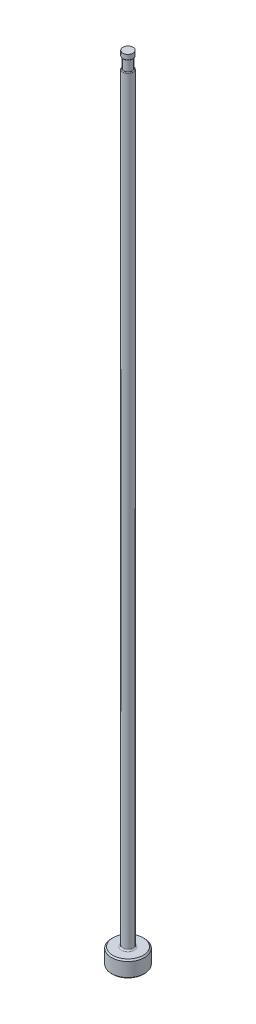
ISO-10303-21;
HEADER;
FILE_DESCRIPTION(('STEP AP214'),'2;1');
FILE_NAME('part.step','',(''),(''),'','','');
FILE_SCHEMA(('AUTOMOTIVE_DESIGN { 1 0 10303 214 1 1 1 1 }'));
ENDSEC;
DATA;
#1=APPLICATION_CONTEXT('core data for automotive mechanical design processes');
#2=APPLICATION_PROTOCOL_DEFINITION('international standard','automotive_design',2000,#1);
#3=PRODUCT_CONTEXT('',#1,'mechanical');
#4=PRODUCT('Part','Part','',(#3));
#5=PRODUCT_RELATED_PRODUCT_CATEGORY('part','',(#4));
#6=PRODUCT_DEFINITION_FORMATION('','',#4);
#7=PRODUCT_DEFINITION_CONTEXT('part definition',#1,'design');
#8=PRODUCT_DEFINITION('design','',#6,#7);
#9=PRODUCT_DEFINITION_SHAPE('','',#8);
#10=(LENGTH_UNIT() NAMED_UNIT(*) SI_UNIT(.MILLI.,.METRE.));
#11=(NAMED_UNIT(*) PLANE_ANGLE_UNIT() SI_UNIT($,.RADIAN.));
#12=(NAMED_UNIT(*) SI_UNIT($,.STERADIAN.) SOLID_ANGLE_UNIT());
#13=UNCERTAINTY_MEASURE_WITH_UNIT(LENGTH_MEASURE(1.E-05),#10,'distance_accuracy_value','');
#14=(GEOMETRIC_REPRESENTATION_CONTEXT(3) GLOBAL_UNCERTAINTY_ASSIGNED_CONTEXT((#13)) GLOBAL_UNIT_ASSIGNED_CONTEXT((#10,
#11,#12)) REPRESENTATION_CONTEXT('',''));
#15=CARTESIAN_POINT('',(0.,0.,0.));
#16=DIRECTION('',(0.,0.,1.));
#17=DIRECTION('',(1.,0.,0.));
#18=AXIS2_PLACEMENT_3D('',#15,#16,#17);
#19=CARTESIAN_POINT('',(-0.991869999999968,151.384,0.));
#20=DIRECTION('',(0.,1.,0.));
#21=DIRECTION('',(0.,0.,1.));
#22=AXIS2_PLACEMENT_3D('',#19,#20,#21);
#23=PLANE('',#22);
#24=CARTESIAN_POINT('',(0.,151.384,0.));
#25=DIRECTION('',(0.,1.,0.));
#26=DIRECTION('',(0.,0.,1.));
#27=AXIS2_PLACEMENT_3D('',#24,#25,#26);
#28=CIRCLE('',#27,0.859789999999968);
#29=CARTESIAN_POINT('',(0.,151.384,0.859789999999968));
#30=VERTEX_POINT('',#29);
#31=EDGE_CURVE('E11',#30,#30,#28,.F.);
#32=ORIENTED_EDGE('',*,*,#31,.T.);
#33=EDGE_LOOP('',(#32));
#34=FACE_BOUND('',#33,.T.);
#35=CARTESIAN_POINT('',(0.,151.384,0.));
#36=DIRECTION('',(0.,1.,0.));
#37=DIRECTION('',(0.,0.,1.));
#38=AXIS2_PLACEMENT_3D('',#35,#36,#37);
#39=CIRCLE('',#38,0.788669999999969);
#40=CARTESIAN_POINT('',(0.,151.384,0.788669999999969));
#41=VERTEX_POINT('',#40);
#42=EDGE_CURVE('E78',#41,#41,#39,.T.);
#43=ORIENTED_EDGE('',*,*,#42,.T.);
#44=EDGE_LOOP('',(#43));
#45=FACE_BOUND('',#44,.T.);
#46=ADVANCED_FACE('F36',(#34,#45),#23,.F.);
#47=CARTESIAN_POINT('',(0.,259.958771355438,0.));
#48=DIRECTION('',(0.,1.,0.));
#49=DIRECTION('',(0.,0.,1.));
#50=AXIS2_PLACEMENT_3D('',#47,#48,#49);
#51=CYLINDRICAL_SURFACE('',#50,0.991869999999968);
#52=DIRECTION('',(0.,1.,0.));
#53=VECTOR('',#52,1.);
#54=CARTESIAN_POINT('',(-0.788669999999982,259.958771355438,-0.601502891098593));
#55=LINE('',#54,#53);
#56=CARTESIAN_POINT('',(-0.788669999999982,149.225,-0.601502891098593));
#57=VERTEX_POINT('',#56);
#58=CARTESIAN_POINT('',(-0.788669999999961,86.868,-0.601502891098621));
#59=VERTEX_POINT('',#58);
#60=EDGE_CURVE('E73',#57,#59,#55,.F.);
#61=ORIENTED_EDGE('',*,*,#60,.F.);
#62=CARTESIAN_POINT('',(0.,149.225,0.));
#63=DIRECTION('',(0.,-1.,0.));
#64=DIRECTION('',(0.,0.,-1.));
#65=AXIS2_PLACEMENT_3D('',#62,#63,#64);
#66=CIRCLE('',#65,0.991869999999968);
#67=CARTESIAN_POINT('',(-0.788669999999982,149.225,0.601502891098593));
#68=VERTEX_POINT('',#67);
#69=EDGE_CURVE('E51',#57,#68,#66,.T.);
#70=ORIENTED_EDGE('',*,*,#69,.T.);
#71=DIRECTION('',(0.,1.,0.));
#72=VECTOR('',#71,1.);
#73=CARTESIAN_POINT('',(-0.788669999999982,259.958771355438,0.601502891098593));
#74=LINE('',#73,#72);
#75=CARTESIAN_POINT('',(-0.788669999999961,86.868,0.601502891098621));
#76=VERTEX_POINT('',#75);
#77=EDGE_CURVE('E84',#76,#68,#74,.T.);
#78=ORIENTED_EDGE('',*,*,#77,.F.);
#79=CARTESIAN_POINT('',(-0.78866999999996,86.868,-0.601502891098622));
#80=CARTESIAN_POINT('',(-0.788666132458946,86.8263657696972,-0.601487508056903));
#81=CARTESIAN_POINT('',(-0.789488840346,86.7847268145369,-0.600428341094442));
#82=CARTESIAN_POINT('',(-0.792762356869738,86.7015772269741,-0.596110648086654));
#83=CARTESIAN_POINT('',(-0.795215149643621,86.6600668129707,-0.5928494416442));
#84=CARTESIAN_POINT('',(-0.80175031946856,86.5770760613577,-0.583979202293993));
#85=CARTESIAN_POINT('',(-0.805845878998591,86.5355987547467,-0.57835115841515));
#86=CARTESIAN_POINT('',(-0.815598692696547,86.4532848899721,-0.564514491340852));
#87=CARTESIAN_POINT('',(-0.821255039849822,86.4124479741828,-0.556307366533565));
#88=CARTESIAN_POINT('',(-0.835799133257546,86.3204854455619,-0.534292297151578));
#89=CARTESIAN_POINT('',(-0.845147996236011,86.269646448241,-0.51956237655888));
#90=CARTESIAN_POINT('',(-0.865829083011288,86.1704630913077,-0.484320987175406));
#91=CARTESIAN_POINT('',(-0.877157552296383,86.122114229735,-0.463820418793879));
#92=CARTESIAN_POINT('',(-0.898053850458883,86.041005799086,-0.421558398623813));
#93=CARTESIAN_POINT('',(-0.907358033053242,86.0073614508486,-0.401380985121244));
#94=CARTESIAN_POINT('',(-0.926056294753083,85.9435419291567,-0.356125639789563));
#95=CARTESIAN_POINT('',(-0.935450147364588,85.9133597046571,-0.331057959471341));
#96=CARTESIAN_POINT('',(-0.950231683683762,85.8679121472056,-0.285005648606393));
#97=CARTESIAN_POINT('',(-0.955876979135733,85.8511082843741,-0.265630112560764));
#98=CARTESIAN_POINT('',(-0.966384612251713,85.8205435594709,-0.224405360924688));
#99=CARTESIAN_POINT('',(-0.971247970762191,85.8067787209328,-0.202559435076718));
#100=CARTESIAN_POINT('',(-0.978947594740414,85.7853348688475,-0.160730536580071));
#101=CARTESIAN_POINT('',(-0.981991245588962,85.7770060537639,-0.141121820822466));
#102=CARTESIAN_POINT('',(-0.986954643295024,85.7635350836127,-0.100697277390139));
#103=CARTESIAN_POINT('',(-0.988875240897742,85.7583905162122,-0.0798823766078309));
#104=CARTESIAN_POINT('',(-0.991389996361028,85.7516710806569,-0.037480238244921));
#105=CARTESIAN_POINT('',(-0.991977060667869,85.7501153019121,-0.0158894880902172));
#106=CARTESIAN_POINT('',(-0.991730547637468,85.7507708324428,0.0272258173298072));
#107=CARTESIAN_POINT('',(-0.990897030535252,85.7529819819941,0.0487503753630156));
#108=CARTESIAN_POINT('',(-0.988037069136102,85.7606392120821,0.0892607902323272));
#109=CARTESIAN_POINT('',(-0.986115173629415,85.765802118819,0.108309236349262));
#110=CARTESIAN_POINT('',(-0.98134109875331,85.7787860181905,0.145344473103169));
#111=CARTESIAN_POINT('',(-0.978488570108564,85.7866080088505,0.163330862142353));
#112=CARTESIAN_POINT('',(-0.970708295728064,85.8082895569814,0.205331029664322));
#113=CARTESIAN_POINT('',(-0.96541298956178,85.8233036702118,0.228680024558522));
#114=CARTESIAN_POINT('',(-0.953964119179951,85.8567581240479,0.272534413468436));
#115=CARTESIAN_POINT('',(-0.947808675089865,85.8752059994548,0.293033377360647));
#116=CARTESIAN_POINT('',(-0.931801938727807,85.9249271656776,0.341318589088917));
#117=CARTESIAN_POINT('',(-0.921702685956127,85.9578591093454,0.367302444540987));
#118=CARTESIAN_POINT('',(-0.901756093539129,86.0273884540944,0.413864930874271));
#119=CARTESIAN_POINT('',(-0.891909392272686,86.0639941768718,0.43443088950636));
#120=CARTESIAN_POINT('',(-0.874578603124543,86.1336825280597,0.468207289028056));
#121=CARTESIAN_POINT('',(-0.866965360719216,86.1664263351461,0.482064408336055));
#122=CARTESIAN_POINT('',(-0.852602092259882,86.23313810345,0.507032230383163));
#123=CARTESIAN_POINT('',(-0.845852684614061,86.2671069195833,0.518140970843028));
#124=CARTESIAN_POINT('',(-0.827119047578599,86.3704444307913,0.54794610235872));
#125=CARTESIAN_POINT('',(-0.816676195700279,86.4411386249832,0.56307398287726));
#126=CARTESIAN_POINT('',(-0.801997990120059,86.571402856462,0.583716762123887));
#127=CARTESIAN_POINT('',(-0.796987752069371,86.6307084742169,0.590464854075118));
#128=CARTESIAN_POINT('',(-0.791992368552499,86.71980696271,0.597127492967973));
#129=CARTESIAN_POINT('',(-0.790747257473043,86.7494091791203,0.598772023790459));
#130=CARTESIAN_POINT('',(-0.789085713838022,86.8086736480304,0.600958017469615));
#131=CARTESIAN_POINT('',(-0.788669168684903,86.8383358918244,0.601499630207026));
#132=CARTESIAN_POINT('',(-0.788669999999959,86.868,0.601502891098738));
#133=B_SPLINE_CURVE_WITH_KNOTS('',3,(#79,#80,#81,#82,#83,#84,#85,#86,#87,#88,#89,#90,#91,#92,
#93,#94,#95,#96,#97,#98,#99,#100,#101,#102,#103,#104,#105,#106,#107,#108,#109,#110,#111,#112,
#113,#114,#115,#116,#117,#118,#119,#120,#121,#122,#123,#124,#125,#126,#127,#128,#129,#130,#131,
#132),.UNSPECIFIED.,.F.,.F.,(4,2,2,2,2,2,2,2,2,2,2,2,2,2,2,2,2,2,2,2,2,2,2,2,2,2,4),(0.,
0.124888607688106,0.249929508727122,0.37599455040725,0.501986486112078,0.662910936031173,
0.823533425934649,0.944174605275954,1.06456554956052,1.14311274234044,1.22155654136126,
1.28585720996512,1.350109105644,1.41470198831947,1.47929213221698,1.53853130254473,
1.59779273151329,1.68209646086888,1.76658740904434,1.89530637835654,2.02432379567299,
2.13325396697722,2.24226168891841,2.46062960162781,2.64005592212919,2.72904839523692,
2.81802877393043),.UNSPECIFIED.);
#134=EDGE_CURVE('E81',#59,#76,#133,.T.);
#135=ORIENTED_EDGE('',*,*,#134,.F.);
#136=EDGE_LOOP('',(#61,#70,#78,#135));
#137=FACE_BOUND('',#136,.T.);
#138=CARTESIAN_POINT('',(0.,3.42900000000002,0.));
#139=DIRECTION('',(0.,1.,0.));
#140=DIRECTION('',(0.,0.,1.));
#141=AXIS2_PLACEMENT_3D('',#138,#139,#140);
#142=CIRCLE('',#141,0.991869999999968);
#143=CARTESIAN_POINT('',(0.,3.42900000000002,0.991869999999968));
#144=VERTEX_POINT('',#143);
#145=EDGE_CURVE('E116',#144,#144,#142,.T.);
#146=ORIENTED_EDGE('',*,*,#145,.T.);
#147=EDGE_LOOP('',(#146));
#148=FACE_BOUND('',#147,.T.);
#149=ADVANCED_FACE('F82',(#137,#148),#51,.T.);
#150=CARTESIAN_POINT('',(0.,0.,0.));
#151=DIRECTION('',(0.,-1.,0.));
#152=DIRECTION('',(0.,0.,-1.));
#153=AXIS2_PLACEMENT_3D('',#150,#151,#152);
#154=PLANE('',#153);
#155=CARTESIAN_POINT('',(0.,0.,0.));
#156=DIRECTION('',(0.,-1.,0.));
#157=DIRECTION('',(0.,0.,-1.));
#158=AXIS2_PLACEMENT_3D('',#155,#156,#157);
#159=CIRCLE('',#158,2.92099999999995);
#160=CARTESIAN_POINT('',(0.,0.,-2.92099999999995));
#161=VERTEX_POINT('',#160);
#162=EDGE_CURVE('E113',#161,#161,#159,.T.);
#163=ORIENTED_EDGE('',*,*,#162,.T.);
#164=EDGE_LOOP('',(#163));
#165=FACE_BOUND('',#164,.T.);
#166=ADVANCED_FACE('F192',(#165),#154,.T.);
#167=CARTESIAN_POINT('',(0.,259.958771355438,0.));
#168=DIRECTION('',(0.,1.,0.));
#169=DIRECTION('',(0.,0.,1.));
#170=AXIS2_PLACEMENT_3D('',#167,#168,#169);
#171=CYLINDRICAL_SURFACE('',#170,3.17499999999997);
#172=CARTESIAN_POINT('',(0.,2.92100000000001,0.));
#173=DIRECTION('',(0.,1.,0.));
#174=DIRECTION('',(0.,0.,1.));
#175=AXIS2_PLACEMENT_3D('',#172,#173,#174);
#176=CIRCLE('',#175,3.17499999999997);
#177=CARTESIAN_POINT('',(0.,2.92100000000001,3.17499999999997));
#178=VERTEX_POINT('',#177);
#179=EDGE_CURVE('E110',#178,#178,#176,.F.);
#180=ORIENTED_EDGE('',*,*,#179,.T.);
#181=EDGE_LOOP('',(#180));
#182=FACE_BOUND('',#181,.T.);
#183=CARTESIAN_POINT('',(0.,0.254000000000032,0.));
#184=DIRECTION('',(0.,-1.,0.));
#185=DIRECTION('',(0.,0.,-1.));
#186=AXIS2_PLACEMENT_3D('',#183,#184,#185);
#187=CIRCLE('',#186,3.17499999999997);
#188=CARTESIAN_POINT('',(0.,0.254000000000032,-3.17499999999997));
#189=VERTEX_POINT('',#188);
#190=EDGE_CURVE('E107',#189,#189,#187,.F.);
#191=ORIENTED_EDGE('',*,*,#190,.T.);
#192=EDGE_LOOP('',(#191));
#193=FACE_BOUND('',#192,.T.);
#194=ADVANCED_FACE('F195',(#182,#193),#171,.T.);
#195=CARTESIAN_POINT('',(-3.17499999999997,3.175,0.));
#196=DIRECTION('',(0.,1.,0.));
#197=DIRECTION('',(0.,0.,1.));
#198=AXIS2_PLACEMENT_3D('',#195,#196,#197);
#199=PLANE('',#198);
#200=CARTESIAN_POINT('',(0.,3.175,0.));
#201=DIRECTION('',(0.,1.,0.));
#202=DIRECTION('',(0.,0.,1.));
#203=AXIS2_PLACEMENT_3D('',#200,#201,#202);
#204=CIRCLE('',#203,1.24586999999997);
#205=CARTESIAN_POINT('',(0.,3.175,1.24586999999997));
#206=VERTEX_POINT('',#205);
#207=EDGE_CURVE('E87',#206,#206,#204,.F.);
#208=ORIENTED_EDGE('',*,*,#207,.T.);
#209=EDGE_LOOP('',(#208));
#210=FACE_BOUND('',#209,.T.);
#211=CARTESIAN_POINT('',(0.,3.175,0.));
#212=DIRECTION('',(0.,1.,0.));
#213=DIRECTION('',(0.,0.,1.));
#214=AXIS2_PLACEMENT_3D('',#211,#212,#213);
#215=CIRCLE('',#214,2.92099999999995);
#216=CARTESIAN_POINT('',(0.,3.175,2.92099999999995));
#217=VERTEX_POINT('',#216);
#218=EDGE_CURVE('E104',#217,#217,#215,.T.);
#219=ORIENTED_EDGE('',*,*,#218,.T.);
#220=EDGE_LOOP('',(#219));
#221=FACE_BOUND('',#220,.T.);
#222=ADVANCED_FACE('F190',(#210,#221),#199,.T.);
#223=CARTESIAN_POINT('',(0.,3.17499999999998,0.));
#224=DIRECTION('',(0.,-1.,0.));
#225=DIRECTION('',(0.,0.,-1.));
#226=AXIS2_PLACEMENT_3D('',#223,#224,#225);
#227=CONICAL_SURFACE('',#226,2.92099999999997,0.7853981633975);
#228=ORIENTED_EDGE('',*,*,#179,.F.);
#229=EDGE_LOOP('',(#228));
#230=FACE_BOUND('',#229,.T.);
#231=ORIENTED_EDGE('',*,*,#218,.F.);
#232=EDGE_LOOP('',(#231));
#233=FACE_BOUND('',#232,.T.);
#234=ADVANCED_FACE('F186',(#230,#233),#227,.T.);
#235=CARTESIAN_POINT('',(0.,0.254000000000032,0.));
#236=DIRECTION('',(0.,1.,0.));
#237=DIRECTION('',(0.,0.,1.));
#238=AXIS2_PLACEMENT_3D('',#235,#236,#237);
#239=CONICAL_SURFACE('',#238,3.17499999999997,0.785398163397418);
#240=ORIENTED_EDGE('',*,*,#162,.F.);
#241=EDGE_LOOP('',(#240));
#242=FACE_BOUND('',#241,.T.);
#243=ORIENTED_EDGE('',*,*,#190,.F.);
#244=EDGE_LOOP('',(#243));
#245=FACE_BOUND('',#244,.T.);
#246=ADVANCED_FACE('F182',(#242,#245),#239,.T.);
#247=CARTESIAN_POINT('',(0.,3.42900000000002,0.));
#248=DIRECTION('',(0.,1.,0.));
#249=DIRECTION('',(0.,0.,1.));
#250=AXIS2_PLACEMENT_3D('',#247,#248,#249);
#251=TOROIDAL_SURFACE('',#250,1.24586999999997,0.254);
#252=ORIENTED_EDGE('',*,*,#207,.F.);
#253=EDGE_LOOP('',(#252));
#254=FACE_BOUND('',#253,.T.);
#255=ORIENTED_EDGE('',*,*,#145,.F.);
#256=EDGE_LOOP('',(#255));
#257=FACE_BOUND('',#256,.T.);
#258=ADVANCED_FACE('F147',(#254,#257),#251,.F.);
#259=CARTESIAN_POINT('',(-0.991869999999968,149.352,0.));
#260=DIRECTION('',(0.,-1.,0.));
#261=DIRECTION('',(0.,0.,-1.));
#262=AXIS2_PLACEMENT_3D('',#259,#260,#261);
#263=PLANE('',#262);
#264=DIRECTION('',(0.,0.,1.));
#265=VECTOR('',#264,1.);
#266=CARTESIAN_POINT('',(-0.788669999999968,149.352,0.));
#267=LINE('',#266,#265);
#268=CARTESIAN_POINT('',(-0.788669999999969,149.352,0.));
#269=VERTEX_POINT('',#268);
#270=CARTESIAN_POINT('',(-0.788669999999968,149.352,0.354964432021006));
#271=VERTEX_POINT('',#270);
#272=EDGE_CURVE('E90',#269,#271,#267,.T.);
#273=ORIENTED_EDGE('',*,*,#272,.T.);
#274=CARTESIAN_POINT('',(0.,149.352,0.));
#275=DIRECTION('',(0.,-1.,0.));
#276=DIRECTION('',(0.,0.,-1.));
#277=AXIS2_PLACEMENT_3D('',#274,#275,#276);
#278=CIRCLE('',#277,0.864869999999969);
#279=CARTESIAN_POINT('',(-0.788669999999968,149.352,-0.354964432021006));
#280=VERTEX_POINT('',#279);
#281=EDGE_CURVE('E86',#271,#280,#278,.F.);
#282=ORIENTED_EDGE('',*,*,#281,.T.);
#283=EDGE_CURVE('E79',#280,#269,#267,.T.);
#284=ORIENTED_EDGE('',*,*,#283,.T.);
#285=CARTESIAN_POINT('',(0.,149.352,0.));
#286=DIRECTION('',(0.,1.,0.));
#287=DIRECTION('',(0.,0.,1.));
#288=AXIS2_PLACEMENT_3D('',#285,#286,#287);
#289=CIRCLE('',#288,0.788669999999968);
#290=EDGE_CURVE('E101',#269,#269,#289,.T.);
#291=ORIENTED_EDGE('',*,*,#290,.F.);
#292=EDGE_LOOP('',(#273,#282,#284,#291));
#293=FACE_BOUND('',#292,.T.);
#294=ADVANCED_FACE('F144',(#293),#263,.F.);
#295=CARTESIAN_POINT('',(0.,153.448281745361,0.));
#296=DIRECTION('',(0.,1.,0.));
#297=DIRECTION('',(0.,0.,1.));
#298=AXIS2_PLACEMENT_3D('',#295,#296,#297);
#299=CYLINDRICAL_SURFACE('',#298,0.788669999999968);
#300=ORIENTED_EDGE('',*,*,#42,.F.);
#301=EDGE_LOOP('',(#300));
#302=FACE_BOUND('',#301,.T.);
#303=ORIENTED_EDGE('',*,*,#290,.T.);
#304=EDGE_LOOP('',(#303));
#305=FACE_BOUND('',#304,.T.);
#306=ADVANCED_FACE('F141',(#302,#305),#299,.T.);
#307=CARTESIAN_POINT('',(-0.788669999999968,150.368,-3.17499999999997));
#308=DIRECTION('',(1.,0.,0.));
#309=DIRECTION('',(0.,1.,0.));
#310=AXIS2_PLACEMENT_3D('',#307,#308,#309);
#311=PLANE('',#310);
#312=ORIENTED_EDGE('',*,*,#283,.F.);
#313=CARTESIAN_POINT('',(-0.788669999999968,149.352,-0.354964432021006));
#314=CARTESIAN_POINT('',(-0.788669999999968,149.351991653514,-0.368137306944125));
#315=CARTESIAN_POINT('',(-0.788669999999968,149.351653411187,-0.381328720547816));
#316=CARTESIAN_POINT('',(-0.788669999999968,149.350063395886,-0.407789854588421));
#317=CARTESIAN_POINT('',(-0.788669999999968,149.348802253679,-0.421058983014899));
#318=CARTESIAN_POINT('',(-0.788669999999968,149.345062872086,-0.447724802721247));
#319=CARTESIAN_POINT('',(-0.788669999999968,149.342559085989,-0.461118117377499));
#320=CARTESIAN_POINT('',(-0.788669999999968,149.335968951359,-0.487472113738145));
#321=CARTESIAN_POINT('',(-0.788669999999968,149.331890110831,-0.50043453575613));
#322=CARTESIAN_POINT('',(-0.788669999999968,149.324061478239,-0.519670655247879));
#323=CARTESIAN_POINT('',(-0.788669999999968,149.32104648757,-0.526242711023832));
#324=CARTESIAN_POINT('',(-0.788669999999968,149.314344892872,-0.539027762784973));
#325=CARTESIAN_POINT('',(-0.788669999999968,149.310659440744,-0.545241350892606));
#326=CARTESIAN_POINT('',(-0.788669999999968,149.302480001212,-0.557211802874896));
#327=CARTESIAN_POINT('',(-0.788669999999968,149.297978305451,-0.56296348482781));
#328=CARTESIAN_POINT('',(-0.788669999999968,149.288105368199,-0.573676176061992));
#329=CARTESIAN_POINT('',(-0.788669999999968,149.282735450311,-0.578638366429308));
#330=CARTESIAN_POINT('',(-0.788669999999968,149.272914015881,-0.586040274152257));
#331=CARTESIAN_POINT('',(-0.788669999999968,149.268693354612,-0.588785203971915));
#332=CARTESIAN_POINT('',(-0.788669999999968,149.259874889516,-0.593566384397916));
#333=CARTESIAN_POINT('',(-0.788669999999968,149.255278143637,-0.595604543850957));
#334=CARTESIAN_POINT('',(-0.788669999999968,149.24644552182,-0.598606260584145));
#335=CARTESIAN_POINT('',(-0.788669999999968,149.242247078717,-0.599679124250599));
#336=CARTESIAN_POINT('',(-0.788669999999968,149.23370249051,-0.601133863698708));
#337=CARTESIAN_POINT('',(-0.788669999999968,149.229355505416,-0.601510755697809));
#338=CARTESIAN_POINT('',(-0.788669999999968,149.225,-0.601502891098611));
#339=B_SPLINE_CURVE_WITH_KNOTS('',3,(#313,#314,#315,#316,#317,#318,#319,#320,#321,#322,#323,
#324,#325,#326,#327,#328,#329,#330,#331,#332,#333,#334,#335,#336,#337,#338),.UNSPECIFIED.,.F.,
.F.,(4,2,2,2,2,2,2,2,2,2,2,2,4),(0.,0.0395434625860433,0.07949403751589,0.120302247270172,
0.160918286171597,0.182579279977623,0.204203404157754,0.226043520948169,0.247850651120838,
0.262901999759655,0.277912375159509,0.290856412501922,0.303892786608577),.UNSPECIFIED.);
#340=EDGE_CURVE('E59',#280,#57,#339,.T.);
#341=ORIENTED_EDGE('',*,*,#340,.T.);
#342=ORIENTED_EDGE('',*,*,#60,.T.);
#343=DIRECTION('',(0.,0.,1.));
#344=VECTOR('',#343,1.);
#345=CARTESIAN_POINT('',(-0.788669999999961,86.868,-3.17499999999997));
#346=LINE('',#345,#344);
#347=EDGE_CURVE('E77',#59,#76,#346,.T.);
#348=ORIENTED_EDGE('',*,*,#347,.T.);
#349=ORIENTED_EDGE('',*,*,#77,.T.);
#350=CARTESIAN_POINT('',(-0.788669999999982,149.225,0.601502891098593));
#351=CARTESIAN_POINT('',(-0.788669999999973,149.230166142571,0.601517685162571));
#352=CARTESIAN_POINT('',(-0.78866999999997,149.235314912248,0.600984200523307));
#353=CARTESIAN_POINT('',(-0.788669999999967,149.245363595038,0.598952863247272));
#354=CARTESIAN_POINT('',(-0.788669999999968,149.250265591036,0.597465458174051));
#355=CARTESIAN_POINT('',(-0.788669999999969,149.259706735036,0.59366073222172));
#356=CARTESIAN_POINT('',(-0.788669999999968,149.264247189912,0.591346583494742));
#357=CARTESIAN_POINT('',(-0.788669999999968,149.272926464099,0.586045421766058));
#358=CARTESIAN_POINT('',(-0.788669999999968,149.277064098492,0.583056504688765));
#359=CARTESIAN_POINT('',(-0.788669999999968,149.286796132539,0.574987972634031));
#360=CARTESIAN_POINT('',(-0.788669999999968,149.292130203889,0.569595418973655));
#361=CARTESIAN_POINT('',(-0.788669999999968,149.301886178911,0.558050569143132));
#362=CARTESIAN_POINT('',(-0.788669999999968,149.306306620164,0.551897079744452));
#363=CARTESIAN_POINT('',(-0.788669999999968,149.316844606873,0.535097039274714));
#364=CARTESIAN_POINT('',(-0.788669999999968,149.322303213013,0.524040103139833));
#365=CARTESIAN_POINT('',(-0.788669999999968,149.331553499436,0.501210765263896));
#366=CARTESIAN_POINT('',(-0.788669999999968,149.335334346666,0.489434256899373));
#367=CARTESIAN_POINT('',(-0.788669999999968,149.343711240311,0.457304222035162));
#368=CARTESIAN_POINT('',(-0.788669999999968,149.347073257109,0.436633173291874));
#369=CARTESIAN_POINT('',(-0.788669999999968,149.350171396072,0.405739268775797));
#370=CARTESIAN_POINT('',(-0.788669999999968,149.350882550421,0.395580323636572));
#371=CARTESIAN_POINT('',(-0.788669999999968,149.351795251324,0.375270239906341));
#372=CARTESIAN_POINT('',(-0.788669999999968,149.351998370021,0.365119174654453));
#373=CARTESIAN_POINT('',(-0.788669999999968,149.352,0.354964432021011));
#374=B_SPLINE_CURVE_WITH_KNOTS('',3,(#350,#351,#352,#353,#354,#355,#356,#357,#358,#359,#360,
#361,#362,#363,#364,#365,#366,#367,#368,#369,#370,#371,#372,#373),.UNSPECIFIED.,.F.,.F.,(4,2,2,
2,2,2,2,2,2,2,2,4),(0.,0.0154434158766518,0.0307205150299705,0.0459396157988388,
0.0612022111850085,0.0838287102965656,0.106491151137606,0.143275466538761,0.180293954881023,
0.242825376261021,0.273372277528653,0.303824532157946),.UNSPECIFIED.);
#375=EDGE_CURVE('E172',#68,#271,#374,.T.);
#376=ORIENTED_EDGE('',*,*,#375,.T.);
#377=ORIENTED_EDGE('',*,*,#272,.F.);
#378=EDGE_LOOP('',(#312,#341,#342,#348,#349,#376,#377));
#379=FACE_BOUND('',#378,.T.);
#380=ADVANCED_FACE('F75',(#379),#311,.F.);
#381=CARTESIAN_POINT('',(-3.96366999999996,86.868,-3.17499999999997));
#382=DIRECTION('',(0.,0.,1.));
#383=DIRECTION('',(1.,0.,0.));
#384=AXIS2_PLACEMENT_3D('',#381,#382,#383);
#385=CYLINDRICAL_SURFACE('',#384,3.175);
#386=ORIENTED_EDGE('',*,*,#347,.F.);
#387=ORIENTED_EDGE('',*,*,#134,.T.);
#388=EDGE_LOOP('',(#386,#387));
#389=FACE_BOUND('',#388,.T.);
#390=ADVANCED_FACE('F89',(#389),#385,.F.);
#391=CARTESIAN_POINT('',(0.,152.687735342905,0.));
#392=DIRECTION('',(0.,1.,0.));
#393=DIRECTION('',(0.,0.,1.));
#394=AXIS2_PLACEMENT_3D('',#391,#392,#393);
#395=CYLINDRICAL_SURFACE('',#394,0.986789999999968);
#396=CARTESIAN_POINT('',(0.,151.511,0.));
#397=DIRECTION('',(0.,1.,0.));
#398=DIRECTION('',(0.,0.,1.));
#399=AXIS2_PLACEMENT_3D('',#396,#397,#398);
#400=CIRCLE('',#399,0.986789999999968);
#401=CARTESIAN_POINT('',(0.,151.511,0.986789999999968));
#402=VERTEX_POINT('',#401);
#403=EDGE_CURVE('E44',#402,#402,#400,.T.);
#404=ORIENTED_EDGE('',*,*,#403,.T.);
#405=EDGE_LOOP('',(#404));
#406=FACE_BOUND('',#405,.T.);
#407=CARTESIAN_POINT('',(0.,152.4,0.));
#408=DIRECTION('',(0.,1.,0.));
#409=DIRECTION('',(0.,0.,1.));
#410=AXIS2_PLACEMENT_3D('',#407,#408,#409);
#411=CIRCLE('',#410,0.986789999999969);
#412=CARTESIAN_POINT('',(0.,152.4,0.986789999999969));
#413=VERTEX_POINT('',#412);
#414=EDGE_CURVE('E91',#413,#413,#411,.T.);
#415=ORIENTED_EDGE('',*,*,#414,.F.);
#416=EDGE_LOOP('',(#415));
#417=FACE_BOUND('',#416,.T.);
#418=ADVANCED_FACE('F135',(#406,#417),#395,.T.);
#419=CARTESIAN_POINT('',(-0.991869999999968,152.4,0.));
#420=DIRECTION('',(0.,1.,0.));
#421=DIRECTION('',(0.,0.,1.));
#422=AXIS2_PLACEMENT_3D('',#419,#420,#421);
#423=PLANE('',#422);
#424=ORIENTED_EDGE('',*,*,#414,.T.);
#425=EDGE_LOOP('',(#424));
#426=FACE_BOUND('',#425,.T.);
#427=ADVANCED_FACE('F149',(#426),#423,.T.);
#428=CARTESIAN_POINT('',(0.,149.225,0.));
#429=DIRECTION('',(0.,-1.,0.));
#430=DIRECTION('',(0.,0.,-1.));
#431=AXIS2_PLACEMENT_3D('',#428,#429,#430);
#432=TOROIDAL_SURFACE('',#431,0.864869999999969,0.127);
#433=ORIENTED_EDGE('',*,*,#375,.F.);
#434=ORIENTED_EDGE('',*,*,#69,.F.);
#435=ORIENTED_EDGE('',*,*,#340,.F.);
#436=ORIENTED_EDGE('',*,*,#281,.F.);
#437=EDGE_LOOP('',(#433,#434,#435,#436));
#438=FACE_BOUND('',#437,.T.);
#439=ADVANCED_FACE('F151',(#438),#432,.T.);
#440=CARTESIAN_POINT('',(0.,151.511,0.));
#441=DIRECTION('',(0.,1.,0.));
#442=DIRECTION('',(0.,0.,1.));
#443=AXIS2_PLACEMENT_3D('',#440,#441,#442);
#444=TOROIDAL_SURFACE('',#443,0.859789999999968,0.127);
#445=ORIENTED_EDGE('',*,*,#31,.F.);
#446=EDGE_LOOP('',(#445));
#447=FACE_BOUND('',#446,.T.);
#448=ORIENTED_EDGE('',*,*,#403,.F.);
#449=EDGE_LOOP('',(#448));
#450=FACE_BOUND('',#449,.T.);
#451=ADVANCED_FACE('F38',(#447,#450),#444,.T.);
#452=CLOSED_SHELL('',(#46,#149,#166,#194,#222,#234,#246,#258,#294,#306,#380,#390,#418,#427,#439,#451));
#453=MANIFOLD_SOLID_BREP('B2',#452);
#454=ADVANCED_BREP_SHAPE_REPRESENTATION('',(#18,#453),#14);
#455=SHAPE_DEFINITION_REPRESENTATION(#9,#454);
ENDSEC;
END-ISO-10303-21;
